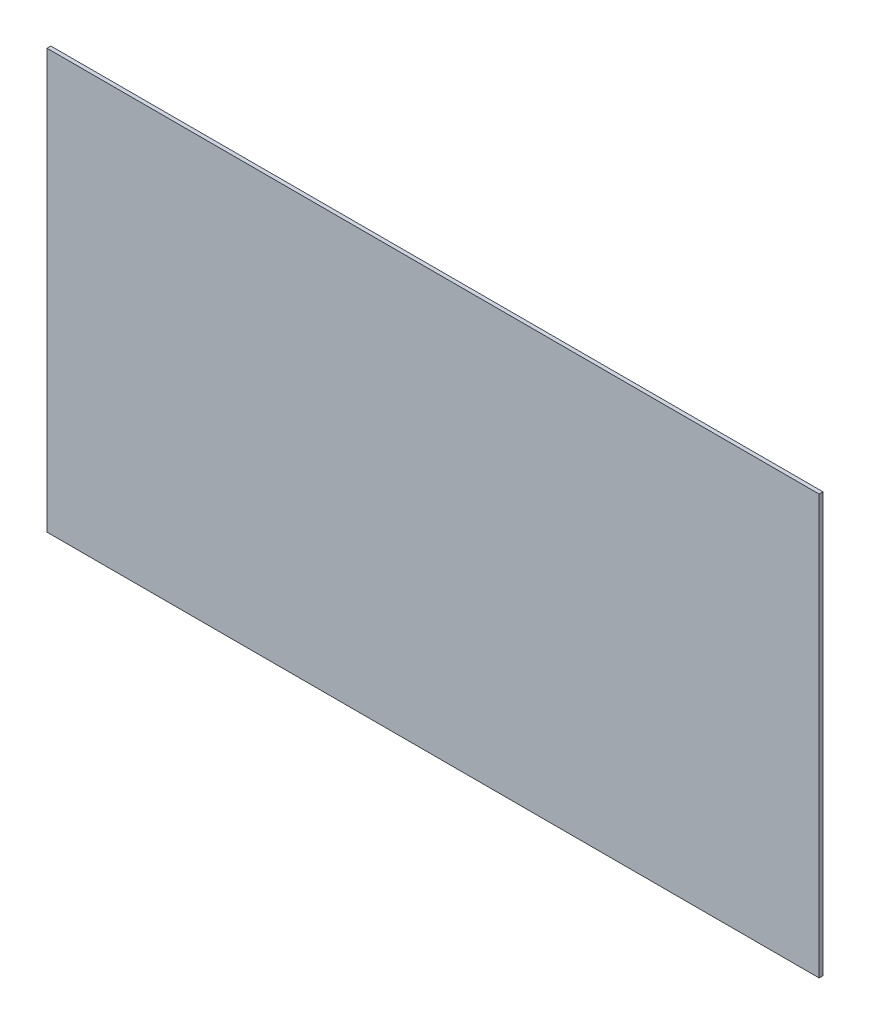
ISO-10303-21;
HEADER;
FILE_DESCRIPTION(('STEP AP214'),'2;1');
FILE_NAME('part.step','',(''),(''),'','','');
FILE_SCHEMA(('AUTOMOTIVE_DESIGN { 1 0 10303 214 1 1 1 1 }'));
ENDSEC;
DATA;
#1=APPLICATION_CONTEXT('core data for automotive mechanical design processes');
#2=APPLICATION_PROTOCOL_DEFINITION('international standard','automotive_design',2000,#1);
#3=PRODUCT_CONTEXT('',#1,'mechanical');
#4=PRODUCT('Part','Part','',(#3));
#5=PRODUCT_RELATED_PRODUCT_CATEGORY('part','',(#4));
#6=PRODUCT_DEFINITION_FORMATION('','',#4);
#7=PRODUCT_DEFINITION_CONTEXT('part definition',#1,'design');
#8=PRODUCT_DEFINITION('design','',#6,#7);
#9=PRODUCT_DEFINITION_SHAPE('','',#8);
#10=(LENGTH_UNIT() NAMED_UNIT(*) SI_UNIT(.MILLI.,.METRE.));
#11=(NAMED_UNIT(*) PLANE_ANGLE_UNIT() SI_UNIT($,.RADIAN.));
#12=(NAMED_UNIT(*) SI_UNIT($,.STERADIAN.) SOLID_ANGLE_UNIT());
#13=UNCERTAINTY_MEASURE_WITH_UNIT(LENGTH_MEASURE(1.E-05),#10,'distance_accuracy_value','');
#14=(GEOMETRIC_REPRESENTATION_CONTEXT(3) GLOBAL_UNCERTAINTY_ASSIGNED_CONTEXT((#13)) GLOBAL_UNIT_ASSIGNED_CONTEXT((#10,
#11,#12)) REPRESENTATION_CONTEXT('',''));
#15=CARTESIAN_POINT('',(0.,0.,0.));
#16=DIRECTION('',(0.,0.,1.));
#17=DIRECTION('',(1.,0.,0.));
#18=AXIS2_PLACEMENT_3D('',#15,#16,#17);
#19=CARTESIAN_POINT('',(-74.0775962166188,-52.891607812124,1.));
#20=DIRECTION('',(0.,1.,0.));
#21=DIRECTION('',(-1.,0.,0.));
#22=AXIS2_PLACEMENT_3D('',#19,#20,#21);
#23=PLANE('',#22);
#24=DIRECTION('',(1.,0.,0.));
#25=VECTOR('',#24,1.);
#26=CARTESIAN_POINT('',(-74.0775962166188,-52.891607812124,0.));
#27=LINE('',#26,#25);
#28=CARTESIAN_POINT('',(-74.0775962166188,-52.891607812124,0.));
#29=VERTEX_POINT('',#28);
#30=CARTESIAN_POINT('',(125.922403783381,-52.8916078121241,0.));
#31=VERTEX_POINT('',#30);
#32=EDGE_CURVE('E106',#29,#31,#27,.T.);
#33=ORIENTED_EDGE('',*,*,#32,.T.);
#34=DIRECTION('',(0.,0.,-1.));
#35=VECTOR('',#34,1.);
#36=CARTESIAN_POINT('',(125.922403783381,-52.8916078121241,1.));
#37=LINE('',#36,#35);
#38=CARTESIAN_POINT('',(125.922403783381,-52.8916078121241,1.));
#39=VERTEX_POINT('',#38);
#40=EDGE_CURVE('E11',#39,#31,#37,.T.);
#41=ORIENTED_EDGE('',*,*,#40,.F.);
#42=DIRECTION('',(1.,0.,0.));
#43=VECTOR('',#42,1.);
#44=CARTESIAN_POINT('',(-74.0775962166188,-52.891607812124,1.));
#45=LINE('',#44,#43);
#46=CARTESIAN_POINT('',(-74.0775962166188,-52.891607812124,1.));
#47=VERTEX_POINT('',#46);
#48=EDGE_CURVE('E94',#47,#39,#45,.T.);
#49=ORIENTED_EDGE('',*,*,#48,.F.);
#50=DIRECTION('',(0.,0.,-1.));
#51=VECTOR('',#50,1.);
#52=CARTESIAN_POINT('',(-74.0775962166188,-52.891607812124,1.));
#53=LINE('',#52,#51);
#54=EDGE_CURVE('E102',#47,#29,#53,.T.);
#55=ORIENTED_EDGE('',*,*,#54,.T.);
#56=EDGE_LOOP('',(#33,#41,#49,#55));
#57=FACE_BOUND('',#56,.T.);
#58=ADVANCED_FACE('F43',(#57),#23,.F.);
#59=CARTESIAN_POINT('',(125.922403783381,-52.8916078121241,1.));
#60=DIRECTION('',(-1.,0.,0.));
#61=DIRECTION('',(0.,0.,1.));
#62=AXIS2_PLACEMENT_3D('',#59,#60,#61);
#63=PLANE('',#62);
#64=DIRECTION('',(0.,1.,0.));
#65=VECTOR('',#64,1.);
#66=CARTESIAN_POINT('',(125.922403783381,-52.8916078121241,0.));
#67=LINE('',#66,#65);
#68=CARTESIAN_POINT('',(125.922403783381,55.6588191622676,0.));
#69=VERTEX_POINT('',#68);
#70=EDGE_CURVE('E98',#31,#69,#67,.T.);
#71=ORIENTED_EDGE('',*,*,#70,.T.);
#72=DIRECTION('',(0.,0.,-1.));
#73=VECTOR('',#72,1.);
#74=CARTESIAN_POINT('',(125.922403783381,55.6588191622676,1.));
#75=LINE('',#74,#73);
#76=CARTESIAN_POINT('',(125.922403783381,55.6588191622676,1.));
#77=VERTEX_POINT('',#76);
#78=EDGE_CURVE('E51',#77,#69,#75,.T.);
#79=ORIENTED_EDGE('',*,*,#78,.F.);
#80=DIRECTION('',(0.,1.,0.));
#81=VECTOR('',#80,1.);
#82=CARTESIAN_POINT('',(125.922403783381,-52.8916078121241,1.));
#83=LINE('',#82,#81);
#84=EDGE_CURVE('E89',#39,#77,#83,.T.);
#85=ORIENTED_EDGE('',*,*,#84,.F.);
#86=ORIENTED_EDGE('',*,*,#40,.T.);
#87=EDGE_LOOP('',(#71,#79,#85,#86));
#88=FACE_BOUND('',#87,.T.);
#89=ADVANCED_FACE('F97',(#88),#63,.F.);
#90=CARTESIAN_POINT('',(125.922403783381,55.6588191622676,1.));
#91=DIRECTION('',(0.,-1.,0.));
#92=DIRECTION('',(0.,0.,-1.));
#93=AXIS2_PLACEMENT_3D('',#90,#91,#92);
#94=PLANE('',#93);
#95=DIRECTION('',(-1.,0.,0.));
#96=VECTOR('',#95,1.);
#97=CARTESIAN_POINT('',(125.922403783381,55.6588191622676,0.));
#98=LINE('',#97,#96);
#99=CARTESIAN_POINT('',(-74.0775962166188,55.6588191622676,0.));
#100=VERTEX_POINT('',#99);
#101=EDGE_CURVE('E76',#69,#100,#98,.T.);
#102=ORIENTED_EDGE('',*,*,#101,.T.);
#103=DIRECTION('',(0.,0.,-1.));
#104=VECTOR('',#103,1.);
#105=CARTESIAN_POINT('',(-74.0775962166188,55.6588191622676,1.));
#106=LINE('',#105,#104);
#107=CARTESIAN_POINT('',(-74.0775962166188,55.6588191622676,1.));
#108=VERTEX_POINT('',#107);
#109=EDGE_CURVE('E99',#108,#100,#106,.T.);
#110=ORIENTED_EDGE('',*,*,#109,.F.);
#111=DIRECTION('',(-1.,0.,0.));
#112=VECTOR('',#111,1.);
#113=CARTESIAN_POINT('',(125.922403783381,55.6588191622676,1.));
#114=LINE('',#113,#112);
#115=EDGE_CURVE('E92',#77,#108,#114,.T.);
#116=ORIENTED_EDGE('',*,*,#115,.F.);
#117=ORIENTED_EDGE('',*,*,#78,.T.);
#118=EDGE_LOOP('',(#102,#110,#116,#117));
#119=FACE_BOUND('',#118,.T.);
#120=ADVANCED_FACE('F100',(#119),#94,.F.);
#121=CARTESIAN_POINT('',(-74.0775962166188,55.6588191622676,1.));
#122=DIRECTION('',(1.,0.,0.));
#123=DIRECTION('',(0.,1.,0.));
#124=AXIS2_PLACEMENT_3D('',#121,#122,#123);
#125=PLANE('',#124);
#126=DIRECTION('',(0.,-1.,0.));
#127=VECTOR('',#126,1.);
#128=CARTESIAN_POINT('',(-74.0775962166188,55.6588191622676,0.));
#129=LINE('',#128,#127);
#130=EDGE_CURVE('E82',#100,#29,#129,.T.);
#131=ORIENTED_EDGE('',*,*,#130,.T.);
#132=ORIENTED_EDGE('',*,*,#54,.F.);
#133=DIRECTION('',(0.,-1.,0.));
#134=VECTOR('',#133,1.);
#135=CARTESIAN_POINT('',(-74.0775962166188,55.6588191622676,1.));
#136=LINE('',#135,#134);
#137=EDGE_CURVE('E59',#108,#47,#136,.T.);
#138=ORIENTED_EDGE('',*,*,#137,.F.);
#139=ORIENTED_EDGE('',*,*,#109,.T.);
#140=EDGE_LOOP('',(#131,#132,#138,#139));
#141=FACE_BOUND('',#140,.T.);
#142=ADVANCED_FACE('F113',(#141),#125,.F.);
#143=CARTESIAN_POINT('',(0.,0.,1.));
#144=DIRECTION('',(0.,0.,1.));
#145=DIRECTION('',(1.,0.,0.));
#146=AXIS2_PLACEMENT_3D('',#143,#144,#145);
#147=PLANE('',#146);
#148=ORIENTED_EDGE('',*,*,#48,.T.);
#149=ORIENTED_EDGE('',*,*,#84,.T.);
#150=ORIENTED_EDGE('',*,*,#115,.T.);
#151=ORIENTED_EDGE('',*,*,#137,.T.);
#152=EDGE_LOOP('',(#148,#149,#150,#151));
#153=FACE_BOUND('',#152,.T.);
#154=ADVANCED_FACE('F90',(#153),#147,.T.);
#155=CARTESIAN_POINT('',(0.,0.,0.));
#156=DIRECTION('',(0.,0.,1.));
#157=DIRECTION('',(1.,0.,0.));
#158=AXIS2_PLACEMENT_3D('',#155,#156,#157);
#159=PLANE('',#158);
#160=ORIENTED_EDGE('',*,*,#32,.F.);
#161=ORIENTED_EDGE('',*,*,#130,.F.);
#162=ORIENTED_EDGE('',*,*,#101,.F.);
#163=ORIENTED_EDGE('',*,*,#70,.F.);
#164=EDGE_LOOP('',(#160,#161,#162,#163));
#165=FACE_BOUND('',#164,.T.);
#166=ADVANCED_FACE('F116',(#165),#159,.F.);
#167=CLOSED_SHELL('',(#58,#89,#120,#142,#154,#166));
#168=MANIFOLD_SOLID_BREP('B2',#167);
#169=ADVANCED_BREP_SHAPE_REPRESENTATION('',(#18,#168),#14);
#170=SHAPE_DEFINITION_REPRESENTATION(#9,#169);
ENDSEC;
END-ISO-10303-21;
